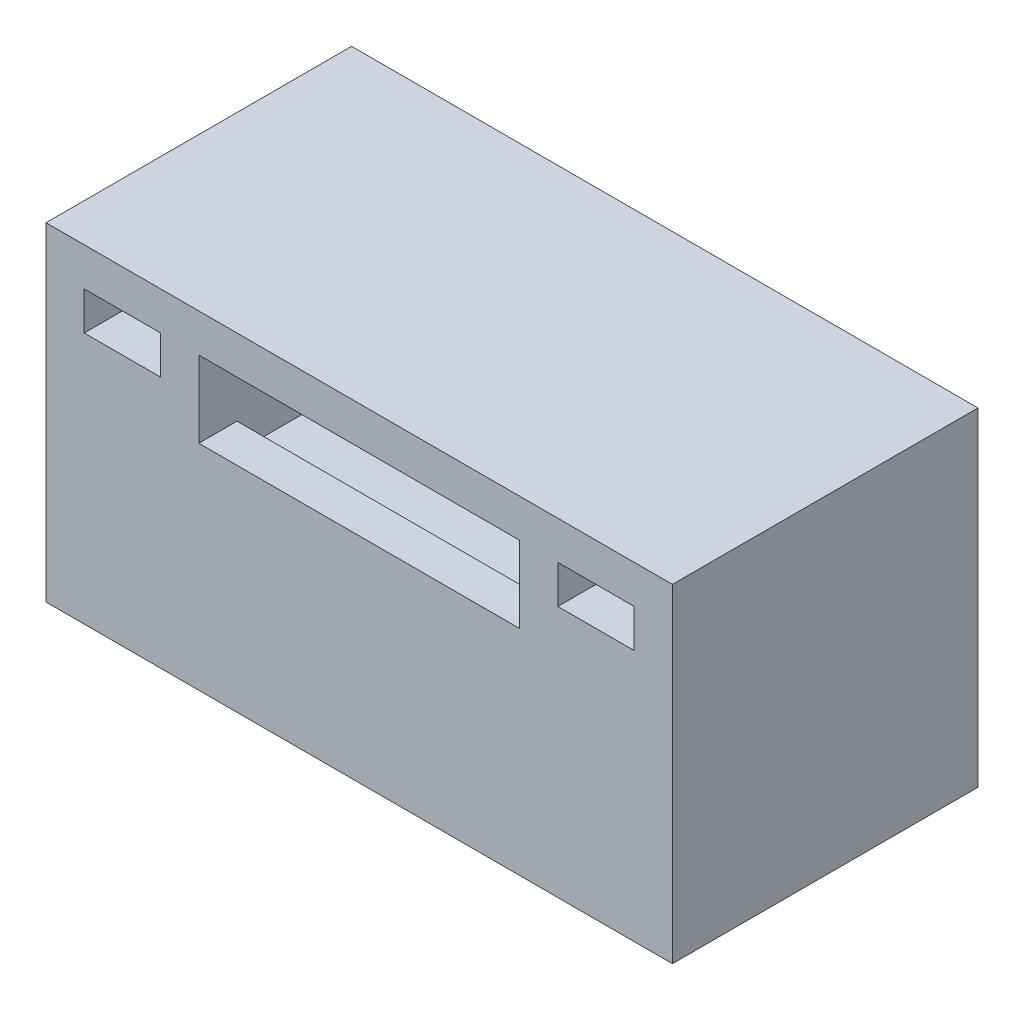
from build123d import *

# Parameters (mm, degrees)
SKETCH_1_W      = 8.2
SKETCH_1_H      = 4.3
SKETCH_1_W_2    = 1
SKETCH_1_H_2    = 0.5
SKETCH_1_W_3    = 4.2
SKETCH_1_H_3    = 1.349417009
EXTRUDE_1_DEPTH = 4
SKETCH_2_W      = 7.2
SKETCH_2_H      = 2.3
EXTRUDE_2_DEPTH = 0.5


with BuildPart() as part:
    # Sketch 1 → Extrude 1 (new body)
    with BuildSketch(Plane.XY):
        Rectangle(SKETCH_1_W, SKETCH_1_H)
        Polygon((2.6, -0.199417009), (-2.6, -0.199417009), (-2.6, 0.65), (-3.6, 0.65), (-3.6, -1.65), (3.6, -1.65), (3.6, 0.65), (2.6, 0.65), align=None, mode=Mode.SUBTRACT)
        with Locations((-3.1, 1.4)):
            Rectangle(SKETCH_1_W_2, SKETCH_1_H_2, mode=Mode.SUBTRACT)
        with Locations((0, 0.975291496)):
            Rectangle(SKETCH_1_W_3, SKETCH_1_H_3, mode=Mode.SUBTRACT)
        with Locations((3.1, 1.4)):
            Rectangle(SKETCH_1_W_2, SKETCH_1_H_2, mode=Mode.SUBTRACT)
    extrude(amount=EXTRUDE_1_DEPTH)

    # Sketch 2 → Extrude 2 (add)
    with BuildSketch(Plane.XY.offset(4)):
        with Locations((0, -0.5)):
            Rectangle(SKETCH_2_W, SKETCH_2_H)
    extrude(amount=-EXTRUDE_2_DEPTH)


solid = part.part
